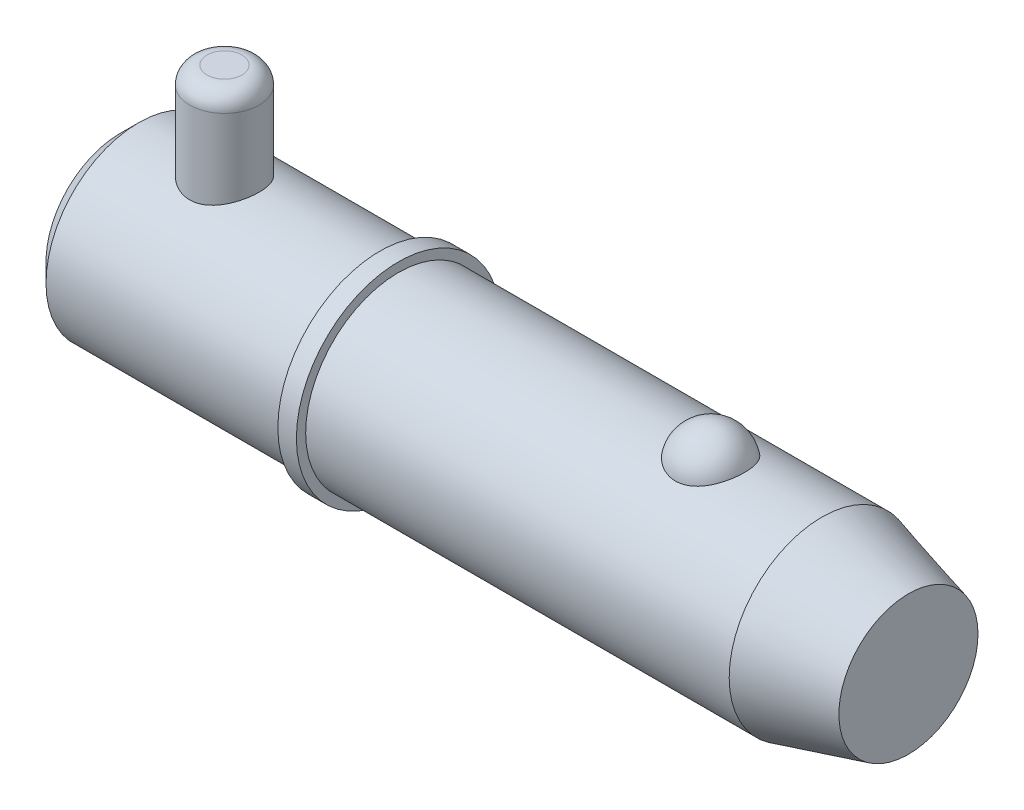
ISO-10303-21;
HEADER;
FILE_DESCRIPTION(('STEP AP214'),'2;1');
FILE_NAME('part.step','',(''),(''),'','','');
FILE_SCHEMA(('AUTOMOTIVE_DESIGN { 1 0 10303 214 1 1 1 1 }'));
ENDSEC;
DATA;
#1=APPLICATION_CONTEXT('core data for automotive mechanical design processes');
#2=APPLICATION_PROTOCOL_DEFINITION('international standard','automotive_design',2000,#1);
#3=PRODUCT_CONTEXT('',#1,'mechanical');
#4=PRODUCT('Part','Part','',(#3));
#5=PRODUCT_RELATED_PRODUCT_CATEGORY('part','',(#4));
#6=PRODUCT_DEFINITION_FORMATION('','',#4);
#7=PRODUCT_DEFINITION_CONTEXT('part definition',#1,'design');
#8=PRODUCT_DEFINITION('design','',#6,#7);
#9=PRODUCT_DEFINITION_SHAPE('','',#8);
#10=(LENGTH_UNIT() NAMED_UNIT(*) SI_UNIT(.MILLI.,.METRE.));
#11=(NAMED_UNIT(*) PLANE_ANGLE_UNIT() SI_UNIT($,.RADIAN.));
#12=(NAMED_UNIT(*) SI_UNIT($,.STERADIAN.) SOLID_ANGLE_UNIT());
#13=UNCERTAINTY_MEASURE_WITH_UNIT(LENGTH_MEASURE(1.E-05),#10,'distance_accuracy_value','');
#14=(GEOMETRIC_REPRESENTATION_CONTEXT(3) GLOBAL_UNCERTAINTY_ASSIGNED_CONTEXT((#13)) GLOBAL_UNIT_ASSIGNED_CONTEXT((#10,
#11,#12)) REPRESENTATION_CONTEXT('',''));
#15=CARTESIAN_POINT('',(0.,0.,0.));
#16=DIRECTION('',(0.,0.,1.));
#17=DIRECTION('',(1.,0.,0.));
#18=AXIS2_PLACEMENT_3D('',#15,#16,#17);
#19=CARTESIAN_POINT('',(14.28,25.4,0.));
#20=DIRECTION('',(0.,-1.,0.));
#21=DIRECTION('',(0.,0.,-1.));
#22=AXIS2_PLACEMENT_3D('',#19,#20,#21);
#23=CYLINDRICAL_SURFACE('',#22,4.76);
#24=CARTESIAN_POINT('',(14.28,-10.32,0.));
#25=DIRECTION('',(0.,1.,0.));
#26=DIRECTION('',(0.,0.,1.));
#27=AXIS2_PLACEMENT_3D('',#24,#25,#26);
#28=CIRCLE('',#27,4.76);
#29=CARTESIAN_POINT('',(14.28,-10.32,-4.76));
#30=VERTEX_POINT('',#29);
#31=EDGE_CURVE('P0_E25',#30,#30,#28,.T.);
#32=CARTESIAN_POINT('',(14.28,23.02,0.));
#33=DIRECTION('',(0.,1.,0.));
#34=DIRECTION('',(0.,0.,1.));
#35=AXIS2_PLACEMENT_3D('',#32,#33,#34);
#36=CIRCLE('',#35,4.76);
#37=CARTESIAN_POINT('',(14.28,23.02,-4.76));
#38=VERTEX_POINT('',#37);
#39=EDGE_CURVE('P0_E29',#38,#38,#36,.F.);
#40=CARTESIAN_POINT('',(14.28,-10.32,-4.76));
#41=CARTESIAN_POINT('',(14.28,-9.97270833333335,-4.76));
#42=CARTESIAN_POINT('',(14.28,-9.62541666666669,-4.76));
#43=CARTESIAN_POINT('',(14.28,-8.93083333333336,-4.76));
#44=CARTESIAN_POINT('',(14.28,-8.58354166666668,-4.76));
#45=CARTESIAN_POINT('',(14.28,-7.88895833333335,-4.76));
#46=CARTESIAN_POINT('',(14.28,-7.54166666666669,-4.76));
#47=CARTESIAN_POINT('',(14.28,-6.84708333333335,-4.76));
#48=CARTESIAN_POINT('',(14.28,-6.49979166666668,-4.76));
#49=CARTESIAN_POINT('',(14.28,-5.80520833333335,-4.76));
#50=CARTESIAN_POINT('',(14.28,-5.45791666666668,-4.76));
#51=CARTESIAN_POINT('',(14.28,-4.76333333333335,-4.76));
#52=CARTESIAN_POINT('',(14.28,-4.41604166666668,-4.76));
#53=CARTESIAN_POINT('',(14.28,-3.72145833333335,-4.76));
#54=CARTESIAN_POINT('',(14.28,-3.37416666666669,-4.76));
#55=CARTESIAN_POINT('',(14.28,-2.67958333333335,-4.76));
#56=CARTESIAN_POINT('',(14.28,-2.33229166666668,-4.76));
#57=CARTESIAN_POINT('',(14.28,-1.63770833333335,-4.76));
#58=CARTESIAN_POINT('',(14.28,-1.29041666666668,-4.76));
#59=CARTESIAN_POINT('',(14.28,-0.595833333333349,-4.76));
#60=CARTESIAN_POINT('',(14.28,-0.24854166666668,-4.76));
#61=CARTESIAN_POINT('',(14.28,0.446041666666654,-4.76));
#62=CARTESIAN_POINT('',(14.28,0.793333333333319,-4.76));
#63=CARTESIAN_POINT('',(14.28,1.48791666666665,-4.76));
#64=CARTESIAN_POINT('',(14.28,1.83520833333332,-4.76));
#65=CARTESIAN_POINT('',(14.28,2.52979166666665,-4.76));
#66=CARTESIAN_POINT('',(14.28,2.87708333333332,-4.76));
#67=CARTESIAN_POINT('',(14.28,3.57166666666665,-4.76));
#68=CARTESIAN_POINT('',(14.28,3.91895833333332,-4.76));
#69=CARTESIAN_POINT('',(14.28,4.61354166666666,-4.76));
#70=CARTESIAN_POINT('',(14.28,4.96083333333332,-4.76));
#71=CARTESIAN_POINT('',(14.28,5.65541666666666,-4.76));
#72=CARTESIAN_POINT('',(14.28,6.00270833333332,-4.76));
#73=CARTESIAN_POINT('',(14.28,6.69729166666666,-4.76));
#74=CARTESIAN_POINT('',(14.28,7.04458333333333,-4.76));
#75=CARTESIAN_POINT('',(14.28,7.73916666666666,-4.76));
#76=CARTESIAN_POINT('',(14.28,8.08645833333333,-4.76));
#77=CARTESIAN_POINT('',(14.28,8.78104166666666,-4.76));
#78=CARTESIAN_POINT('',(14.28,9.12833333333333,-4.76));
#79=CARTESIAN_POINT('',(14.28,9.82291666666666,-4.76));
#80=CARTESIAN_POINT('',(14.28,10.1702083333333,-4.76));
#81=CARTESIAN_POINT('',(14.28,10.8647916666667,-4.76));
#82=CARTESIAN_POINT('',(14.28,11.2120833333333,-4.76));
#83=CARTESIAN_POINT('',(14.28,11.9066666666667,-4.76));
#84=CARTESIAN_POINT('',(14.28,12.2539583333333,-4.76));
#85=CARTESIAN_POINT('',(14.28,12.9485416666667,-4.76));
#86=CARTESIAN_POINT('',(14.28,13.2958333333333,-4.76));
#87=CARTESIAN_POINT('',(14.28,13.9904166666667,-4.76));
#88=CARTESIAN_POINT('',(14.28,14.3377083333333,-4.76));
#89=CARTESIAN_POINT('',(14.28,15.0322916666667,-4.76));
#90=CARTESIAN_POINT('',(14.28,15.3795833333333,-4.76));
#91=CARTESIAN_POINT('',(14.28,16.0741666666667,-4.76));
#92=CARTESIAN_POINT('',(14.28,16.4214583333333,-4.76));
#93=CARTESIAN_POINT('',(14.28,17.1160416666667,-4.76));
#94=CARTESIAN_POINT('',(14.28,17.4633333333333,-4.76));
#95=CARTESIAN_POINT('',(14.28,18.1579166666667,-4.76));
#96=CARTESIAN_POINT('',(14.28,18.5052083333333,-4.76));
#97=CARTESIAN_POINT('',(14.28,19.1997916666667,-4.76));
#98=CARTESIAN_POINT('',(14.28,19.5470833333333,-4.76));
#99=CARTESIAN_POINT('',(14.28,20.2416666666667,-4.76));
#100=CARTESIAN_POINT('',(14.28,20.5889583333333,-4.76));
#101=CARTESIAN_POINT('',(14.28,21.2835416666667,-4.76));
#102=CARTESIAN_POINT('',(14.28,21.6308333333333,-4.76));
#103=CARTESIAN_POINT('',(14.28,22.3254166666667,-4.76));
#104=CARTESIAN_POINT('',(14.28,22.6727083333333,-4.76));
#105=CARTESIAN_POINT('',(14.28,23.02,-4.76));
#106=B_SPLINE_CURVE_WITH_KNOTS('',3,(#40,#41,#42,#43,#44,#45,#46,#47,#48,#49,#50,#51,#52,#53,
#54,#55,#56,#57,#58,#59,#60,#61,#62,#63,#64,#65,#66,#67,#68,#69,#70,#71,#72,#73,#74,#75,#76,#77,
#78,#79,#80,#81,#82,#83,#84,#85,#86,#87,#88,#89,#90,#91,#92,#93,#94,#95,#96,#97,#98,#99,#100,
#101,#102,#103,#104,#105),.UNSPECIFIED.,.F.,.F.,(4,2,2,2,2,2,2,2,2,2,2,2,2,2,2,2,2,2,2,2,2,2,2,
2,2,2,2,2,2,2,2,2,4),(0.,1.041875,2.08375,3.125625,4.1675,5.209375,6.25125,7.293125,
8.33500000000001,9.376875,10.41875,11.460625,12.5025,13.544375,14.58625,15.628125,16.67,
17.711875,18.75375,19.795625,20.8375,21.879375,22.92125,23.963125,25.005,26.046875,27.08875,
28.130625,29.1725,30.214375,31.25625,32.298125,33.34),.UNSPECIFIED.);
#107=EDGE_CURVE('P0_BSEAM14',#30,#38,#106,.T.);
#108=ORIENTED_EDGE('',*,*,#31,.T.);
#109=ORIENTED_EDGE('',*,*,#39,.T.);
#110=ORIENTED_EDGE('',*,*,#107,.T.);
#111=ORIENTED_EDGE('',*,*,#107,.F.);
#112=EDGE_LOOP('',(#108,#110,#109,#111));
#113=FACE_BOUND('',#112,.T.);
#114=ADVANCED_FACE('P0_F14',(#113),#23,.T.);
#115=CARTESIAN_POINT('',(14.28,25.4,0.));
#116=DIRECTION('',(0.,1.,0.));
#117=DIRECTION('',(0.,0.,1.));
#118=AXIS2_PLACEMENT_3D('',#115,#116,#117);
#119=PLANE('',#118);
#120=CARTESIAN_POINT('',(14.28,25.4,0.));
#121=DIRECTION('',(0.,1.,0.));
#122=DIRECTION('',(0.,0.,1.));
#123=AXIS2_PLACEMENT_3D('',#120,#121,#122);
#124=CIRCLE('',#123,2.38);
#125=CARTESIAN_POINT('',(14.28,25.4,2.38));
#126=VERTEX_POINT('',#125);
#127=EDGE_CURVE('P0_E10',#126,#126,#124,.T.);
#128=ORIENTED_EDGE('',*,*,#127,.T.);
#129=EDGE_LOOP('',(#128));
#130=FACE_BOUND('',#129,.T.);
#131=ADVANCED_FACE('P0_F46',(#130),#119,.T.);
#132=CARTESIAN_POINT('',(14.28,-12.7,0.));
#133=DIRECTION('',(0.,1.,0.));
#134=DIRECTION('',(0.,0.,1.));
#135=AXIS2_PLACEMENT_3D('',#132,#133,#134);
#136=PLANE('',#135);
#137=CARTESIAN_POINT('',(14.28,-12.7,0.));
#138=DIRECTION('',(0.,1.,0.));
#139=DIRECTION('',(0.,0.,1.));
#140=AXIS2_PLACEMENT_3D('',#137,#138,#139);
#141=CIRCLE('',#140,2.38);
#142=CARTESIAN_POINT('',(14.28,-12.7,2.38));
#143=VERTEX_POINT('',#142);
#144=EDGE_CURVE('P0_E21',#143,#143,#141,.F.);
#145=ORIENTED_EDGE('',*,*,#144,.T.);
#146=EDGE_LOOP('',(#145));
#147=FACE_BOUND('',#146,.T.);
#148=ADVANCED_FACE('P0_F43',(#147),#136,.F.);
#149=CARTESIAN_POINT('',(14.28,-10.32,0.));
#150=DIRECTION('',(0.,1.,0.));
#151=DIRECTION('',(0.,0.,1.));
#152=AXIS2_PLACEMENT_3D('',#149,#150,#151);
#153=DEGENERATE_TOROIDAL_SURFACE('',#152,2.38,2.38,.T.);
#154=ORIENTED_EDGE('',*,*,#144,.F.);
#155=EDGE_LOOP('',(#154));
#156=FACE_BOUND('',#155,.T.);
#157=ORIENTED_EDGE('',*,*,#31,.F.);
#158=EDGE_LOOP('',(#157));
#159=FACE_BOUND('',#158,.T.);
#160=ADVANCED_FACE('P0_F38',(#156,#159),#153,.T.);
#161=CARTESIAN_POINT('',(14.28,23.02,0.));
#162=DIRECTION('',(0.,1.,0.));
#163=DIRECTION('',(0.,0.,1.));
#164=AXIS2_PLACEMENT_3D('',#161,#162,#163);
#165=DEGENERATE_TOROIDAL_SURFACE('',#164,2.38,2.38,.T.);
#166=ORIENTED_EDGE('',*,*,#39,.F.);
#167=EDGE_LOOP('',(#166));
#168=FACE_BOUND('',#167,.T.);
#169=ORIENTED_EDGE('',*,*,#127,.F.);
#170=EDGE_LOOP('',(#169));
#171=FACE_BOUND('',#170,.T.);
#172=ADVANCED_FACE('P0_F16',(#168,#171),#165,.T.);
#173=CLOSED_SHELL('',(#114,#131,#148,#160,#172));
#174=MANIFOLD_SOLID_BREP('P0_B1',#173);
#175=CARTESIAN_POINT('',(0.,0.,0.));
#176=DIRECTION('',(1.,0.,0.));
#177=DIRECTION('',(0.,0.,-1.));
#178=AXIS2_PLACEMENT_3D('',#175,#176,#177);
#179=CYLINDRICAL_SURFACE('',#178,12.7);
#180=CARTESIAN_POINT('',(96.1007386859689,0.,0.));
#181=DIRECTION('',(1.,0.,0.));
#182=DIRECTION('',(0.,0.,-1.));
#183=AXIS2_PLACEMENT_3D('',#180,#181,#182);
#184=CIRCLE('',#183,12.7);
#185=CARTESIAN_POINT('',(96.1007386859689,0.,-12.7));
#186=VERTEX_POINT('',#185);
#187=EDGE_CURVE('P1_E81',#186,#186,#184,.T.);
#188=ORIENTED_EDGE('',*,*,#187,.F.);
#189=EDGE_LOOP('',(#188));
#190=FACE_BOUND('',#189,.T.);
#191=CARTESIAN_POINT('',(38.1,0.,0.));
#192=DIRECTION('',(1.,0.,0.));
#193=DIRECTION('',(0.,0.,-1.));
#194=AXIS2_PLACEMENT_3D('',#191,#192,#193);
#195=CIRCLE('',#194,12.7);
#196=CARTESIAN_POINT('',(38.1,0.,-12.7));
#197=VERTEX_POINT('',#196);
#198=EDGE_CURVE('P1_E85',#197,#197,#195,.T.);
#199=ORIENTED_EDGE('',*,*,#198,.T.);
#200=EDGE_LOOP('',(#199));
#201=FACE_BOUND('',#200,.T.);
#202=CARTESIAN_POINT('',(80.8600429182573,11.7500437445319,4.81938502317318));
#203=CARTESIAN_POINT('',(80.7350881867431,11.7500430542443,4.81938571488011));
#204=CARTESIAN_POINT('',(80.610144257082,11.7520975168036,4.81438658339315));
#205=CARTESIAN_POINT('',(80.3611425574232,11.760253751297,4.79442904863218));
#206=CARTESIAN_POINT('',(80.2370850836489,11.7663568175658,4.77946746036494));
#207=CARTESIAN_POINT('',(79.9909016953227,11.7824262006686,4.73971414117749));
#208=CARTESIAN_POINT('',(79.8687744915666,11.7923898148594,4.71492928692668));
#209=CARTESIAN_POINT('',(79.6271874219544,11.8158938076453,4.65571340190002));
#210=CARTESIAN_POINT('',(79.5077285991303,11.8294355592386,4.6212786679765));
#211=CARTESIAN_POINT('',(79.2725578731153,11.8596812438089,4.54309502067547));
#212=CARTESIAN_POINT('',(79.1568393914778,11.8763792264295,4.49936361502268));
#213=CARTESIAN_POINT('',(78.9296530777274,11.9124878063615,4.40287235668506));
#214=CARTESIAN_POINT('',(78.8181868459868,11.9318994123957,4.35010914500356));
#215=CARTESIAN_POINT('',(78.4912782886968,11.9934256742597,4.17881316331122));
#216=CARTESIAN_POINT('',(78.2831270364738,12.038858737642,4.04720756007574));
#217=CARTESIAN_POINT('',(77.8858509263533,12.1352173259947,3.748564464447));
#218=CARTESIAN_POINT('',(77.6974438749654,12.1862630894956,3.58061821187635));
#219=CARTESIAN_POINT('',(77.3505213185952,12.2875163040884,3.21600758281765));
#220=CARTESIAN_POINT('',(77.1920113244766,12.3377235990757,3.0193379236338));
#221=CARTESIAN_POINT('',(76.9016887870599,12.4344923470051,2.592916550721));
#222=CARTESIAN_POINT('',(76.7713762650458,12.4807925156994,2.36208286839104));
#223=CARTESIAN_POINT('',(76.5494079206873,12.5623454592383,1.88070399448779));
#224=CARTESIAN_POINT('',(76.4577554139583,12.5975972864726,1.63015711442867));
#225=CARTESIAN_POINT('',(76.3140466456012,12.6538414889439,1.1129886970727));
#226=CARTESIAN_POINT('',(76.2624990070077,12.6746503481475,0.846205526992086));
#227=CARTESIAN_POINT('',(76.2019771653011,12.699153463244,0.307085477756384));
#228=CARTESIAN_POINT('',(76.1930018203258,12.7028481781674,0.034748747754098));
#229=CARTESIAN_POINT('',(76.2177310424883,12.6927785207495,-0.506073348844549));
#230=CARTESIAN_POINT('',(76.2511899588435,12.6791146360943,-0.774571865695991));
#231=CARTESIAN_POINT('',(76.3596877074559,12.635882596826,-1.30170246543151));
#232=CARTESIAN_POINT('',(76.4347272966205,12.606314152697,-1.5603343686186));
#233=CARTESIAN_POINT('',(76.6250000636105,12.5342328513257,-2.06083899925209));
#234=CARTESIAN_POINT('',(76.7402872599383,12.4917026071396,-2.3026886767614));
#235=CARTESIAN_POINT('',(77.0087044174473,12.3981123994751,-2.76259600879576));
#236=CARTESIAN_POINT('',(77.1618374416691,12.3470517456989,-2.98065173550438));
#237=CARTESIAN_POINT('',(77.5035077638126,12.2416045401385,-3.38786328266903));
#238=CARTESIAN_POINT('',(77.6922017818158,12.1872040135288,-3.57688418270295));
#239=CARTESIAN_POINT('',(78.1002392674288,12.0814086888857,-3.91941073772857));
#240=CARTESIAN_POINT('',(78.3195800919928,12.0300136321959,-4.07291945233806));
#241=CARTESIAN_POINT('',(78.7783753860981,11.9373542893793,-4.33691289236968));
#242=CARTESIAN_POINT('',(79.0173044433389,11.8958982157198,-4.44824125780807));
#243=CARTESIAN_POINT('',(79.5124376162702,11.8268116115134,-4.62881985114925));
#244=CARTESIAN_POINT('',(79.7686351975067,11.7991758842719,-4.69808589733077));
#245=CARTESIAN_POINT('',(80.2771640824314,11.7622209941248,-4.78983181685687));
#246=CARTESIAN_POINT('',(80.5290414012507,11.7520502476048,-4.81449025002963));
#247=CARTESIAN_POINT('',(81.0335734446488,11.7485796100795,-4.82295735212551));
#248=CARTESIAN_POINT('',(81.2862280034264,11.7552763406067,-4.80677420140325));
#249=CARTESIAN_POINT('',(81.7768341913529,11.7842584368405,-4.73525430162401));
#250=CARTESIAN_POINT('',(82.0149984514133,11.8060486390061,-4.68116061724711));
#251=CARTESIAN_POINT('',(82.4784894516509,11.8622750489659,-4.53678133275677));
#252=CARTESIAN_POINT('',(82.7038151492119,11.8967122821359,-4.44649279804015));
#253=CARTESIAN_POINT('',(83.1408018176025,11.9754603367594,-4.2298761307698));
#254=CARTESIAN_POINT('',(83.3520579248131,12.0199699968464,-4.10280539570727));
#255=CARTESIAN_POINT('',(83.7506012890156,12.1138028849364,-3.81685409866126));
#256=CARTESIAN_POINT('',(83.9378830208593,12.163127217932,-3.65796622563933));
#257=CARTESIAN_POINT('',(84.2933509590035,12.2642343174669,-3.30364864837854));
#258=CARTESIAN_POINT('',(84.4601119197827,12.3160165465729,-3.10678783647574));
#259=CARTESIAN_POINT('',(84.7595799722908,12.4142566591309,-2.68748409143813));
#260=CARTESIAN_POINT('',(84.8922809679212,12.4607135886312,-2.46503658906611));
#261=CARTESIAN_POINT('',(85.1246912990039,12.5450236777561,-1.99289519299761));
#262=CARTESIAN_POINT('',(85.223215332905,12.5825557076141,-1.7425591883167));
#263=CARTESIAN_POINT('',(85.3792277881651,12.6431720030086,-1.22773734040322));
#264=CARTESIAN_POINT('',(85.4367157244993,12.6662560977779,-0.963251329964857));
#265=CARTESIAN_POINT('',(85.5095441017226,12.6956486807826,-0.427355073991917));
#266=CARTESIAN_POINT('',(85.5248378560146,12.7019385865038,-0.1559374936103));
#267=CARTESIAN_POINT('',(85.5127794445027,12.6970201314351,0.385928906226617));
#268=CARTESIAN_POINT('',(85.4854280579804,12.6858120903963,0.656377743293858));
#269=CARTESIAN_POINT('',(85.4130609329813,12.6568455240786,1.05454017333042));
#270=CARTESIAN_POINT('',(85.3837963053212,12.6451962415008,1.18577850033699));
#271=CARTESIAN_POINT('',(85.3150228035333,12.6181819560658,1.4451380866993));
#272=CARTESIAN_POINT('',(85.2755176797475,12.6028183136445,1.57326046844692));
#273=CARTESIAN_POINT('',(85.1864397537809,12.5687547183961,1.82554978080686));
#274=CARTESIAN_POINT('',(85.1368627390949,12.5500533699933,1.9497150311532));
#275=CARTESIAN_POINT('',(85.0279211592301,12.5098093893,2.19314370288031));
#276=CARTESIAN_POINT('',(84.9685601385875,12.4882677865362,2.31240887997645));
#277=CARTESIAN_POINT('',(84.8399712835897,12.4427679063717,2.54593031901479));
#278=CARTESIAN_POINT('',(84.7706888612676,12.4187964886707,2.66015396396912));
#279=CARTESIAN_POINT('',(84.622903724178,12.3691892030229,2.88202659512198));
#280=CARTESIAN_POINT('',(84.5444044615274,12.3435539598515,2.98967802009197));
#281=CARTESIAN_POINT('',(84.3785502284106,12.2912955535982,3.19774385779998));
#282=CARTESIAN_POINT('',(84.2911918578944,12.2646720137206,3.29815546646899));
#283=CARTESIAN_POINT('',(84.1081617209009,12.2111945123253,3.49095035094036));
#284=CARTESIAN_POINT('',(84.0124932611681,12.1843406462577,3.58333679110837));
#285=CARTESIAN_POINT('',(83.8136272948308,12.1312249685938,3.75922876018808));
#286=CARTESIAN_POINT('',(83.7104503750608,12.104961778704,3.84275713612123));
#287=CARTESIAN_POINT('',(83.4970133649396,12.0537284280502,4.00056406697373));
#288=CARTESIAN_POINT('',(83.3867562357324,12.028757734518,4.07484645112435));
#289=CARTESIAN_POINT('',(83.1597550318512,11.9808306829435,4.21367959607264));
#290=CARTESIAN_POINT('',(83.0430068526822,11.9578756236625,4.27822410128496));
#291=CARTESIAN_POINT('',(82.8039425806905,11.9147184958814,4.39698483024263));
#292=CARTESIAN_POINT('',(82.6816287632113,11.894515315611,4.45120522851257));
#293=CARTESIAN_POINT('',(82.422952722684,11.8561129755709,4.55255353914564));
#294=CARTESIAN_POINT('',(82.2862237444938,11.8381764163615,4.59884858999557));
#295=CARTESIAN_POINT('',(82.0086087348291,11.8069093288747,4.67853897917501));
#296=CARTESIAN_POINT('',(81.8677245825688,11.7935767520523,4.71194005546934));
#297=CARTESIAN_POINT('',(81.5830944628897,11.7720277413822,4.76552188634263));
#298=CARTESIAN_POINT('',(81.4393488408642,11.7638106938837,4.78570422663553));
#299=CARTESIAN_POINT('',(81.1504114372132,11.7528195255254,4.81263433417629));
#300=CARTESIAN_POINT('',(81.0052198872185,11.7500445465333,4.81938421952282));
#301=CARTESIAN_POINT('',(80.8600429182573,11.7500437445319,4.81938502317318));
#302=B_SPLINE_CURVE_WITH_KNOTS('',3,(#202,#203,#204,#205,#206,#207,#208,#209,#210,#211,#212,
#213,#214,#215,#216,#217,#218,#219,#220,#221,#222,#223,#224,#225,#226,#227,#228,#229,#230,#231,
#232,#233,#234,#235,#236,#237,#238,#239,#240,#241,#242,#243,#244,#245,#246,#247,#248,#249,#250,
#251,#252,#253,#254,#255,#256,#257,#258,#259,#260,#261,#262,#263,#264,#265,#266,#267,#268,#269,
#270,#271,#272,#273,#274,#275,#276,#277,#278,#279,#280,#281,#282,#283,#284,#285,#286,#287,#288,
#289,#290,#291,#292,#293,#294,#295,#296,#297,#298,#299,#300,#301),.UNSPECIFIED.,.T.,.F.,(4,2,2,
2,2,2,2,2,2,2,2,2,2,2,2,2,2,2,2,2,2,2,2,2,2,2,2,2,2,2,2,2,2,2,2,2,2,2,2,2,2,2,2,2,2,2,2,2,2,4),
(0.,0.374729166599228,0.749578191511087,1.12416526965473,1.49889629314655,1.87292776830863,
2.24709865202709,2.99481328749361,3.76399449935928,4.53331735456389,5.33683915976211,
6.14042986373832,6.95405296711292,7.76765424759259,8.57656703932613,9.38549455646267,
10.1955119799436,11.0055949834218,11.8193353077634,12.6330054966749,13.4294141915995,
14.2255231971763,14.9815786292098,15.7374826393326,16.4696948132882,17.2019663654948,
17.9501979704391,18.6986017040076,19.484470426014,20.2704797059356,21.0815215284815,
21.8925729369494,22.7045213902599,23.5164550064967,23.9209608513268,24.3253187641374,
24.7298461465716,25.1342272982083,25.54092555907,25.9474719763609,26.3541750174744,
26.7607169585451,27.1661834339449,27.5714814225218,27.9770386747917,28.3824315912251,
28.8181206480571,29.2536155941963,29.6890582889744,30.1244323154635),.UNSPECIFIED.);
#303=CARTESIAN_POINT('',(80.8600429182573,11.7500437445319,4.81938502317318));
#304=VERTEX_POINT('',#303);
#305=EDGE_CURVE('P1_E35',#304,#304,#302,.T.);
#306=ORIENTED_EDGE('',*,*,#305,.T.);
#307=EDGE_LOOP('',(#306));
#308=FACE_BOUND('',#307,.T.);
#309=ADVANCED_FACE('P1_F13',(#190,#201,#308),#179,.T.);
#310=CARTESIAN_POINT('',(0.,0.,0.));
#311=DIRECTION('',(-1.,0.,0.));
#312=DIRECTION('',(0.,0.,1.));
#313=AXIS2_PLACEMENT_3D('',#310,#311,#312);
#314=PLANE('',#313);
#315=CARTESIAN_POINT('',(0.,0.,0.));
#316=DIRECTION('',(1.,0.,0.));
#317=DIRECTION('',(0.,0.,-1.));
#318=AXIS2_PLACEMENT_3D('',#315,#316,#317);
#319=CIRCLE('',#318,10.16);
#320=CARTESIAN_POINT('',(0.,0.,-10.16));
#321=VERTEX_POINT('',#320);
#322=EDGE_CURVE('P1_E9',#321,#321,#319,.T.);
#323=ORIENTED_EDGE('',*,*,#322,.F.);
#324=EDGE_LOOP('',(#323));
#325=FACE_BOUND('',#324,.T.);
#326=ADVANCED_FACE('P1_F15',(#325),#314,.T.);
#327=CARTESIAN_POINT('',(2.53999999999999,0.,0.));
#328=DIRECTION('',(1.,0.,0.));
#329=DIRECTION('',(0.,0.,-1.));
#330=AXIS2_PLACEMENT_3D('',#327,#328,#329);
#331=CONICAL_SURFACE('',#330,12.7,0.78539816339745);
#332=ORIENTED_EDGE('',*,*,#322,.T.);
#333=EDGE_LOOP('',(#332));
#334=FACE_BOUND('',#333,.T.);
#335=CARTESIAN_POINT('',(2.53999999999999,0.,0.));
#336=DIRECTION('',(1.,0.,0.));
#337=DIRECTION('',(0.,0.,-1.));
#338=AXIS2_PLACEMENT_3D('',#335,#336,#337);
#339=CIRCLE('',#338,12.7);
#340=CARTESIAN_POINT('',(2.53999999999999,0.,-12.7));
#341=VERTEX_POINT('',#340);
#342=EDGE_CURVE('P1_E26',#341,#341,#339,.T.);
#343=ORIENTED_EDGE('',*,*,#342,.F.);
#344=EDGE_LOOP('',(#343));
#345=FACE_BOUND('',#344,.T.);
#346=ADVANCED_FACE('P1_F77',(#334,#345),#331,.T.);
#347=CARTESIAN_POINT('',(0.,0.,0.));
#348=DIRECTION('',(1.,0.,0.));
#349=DIRECTION('',(0.,0.,-1.));
#350=AXIS2_PLACEMENT_3D('',#347,#348,#349);
#351=CYLINDRICAL_SURFACE('',#350,12.7);
#352=CARTESIAN_POINT('',(14.28,-11.7742260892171,4.76));
#353=CARTESIAN_POINT('',(14.1514948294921,-11.7742255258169,4.76000061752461));
#354=CARTESIAN_POINT('',(14.0229980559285,-11.7763355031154,4.75479194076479));
#355=CARTESIAN_POINT('',(13.7669369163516,-11.7847043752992,4.73401198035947));
#356=CARTESIAN_POINT('',(13.6393728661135,-11.7909646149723,4.71843733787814));
#357=CARTESIAN_POINT('',(13.386226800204,-11.8074248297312,4.67709434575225));
#358=CARTESIAN_POINT('',(13.2606439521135,-11.8176231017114,4.65133040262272));
#359=CARTESIAN_POINT('',(13.0122434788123,-11.8416347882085,4.58985545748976));
#360=CARTESIAN_POINT('',(12.8894269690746,-11.8554496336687,4.55414051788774));
#361=CARTESIAN_POINT('',(12.6477622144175,-11.8862222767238,4.47320764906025));
#362=CARTESIAN_POINT('',(12.5289037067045,-11.9031710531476,4.4280169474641));
#363=CARTESIAN_POINT('',(12.2955059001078,-11.939736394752,4.32845291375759));
#364=CARTESIAN_POINT('',(12.1809682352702,-11.9593539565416,4.2740761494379));
#365=CARTESIAN_POINT('',(11.8448901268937,-12.0213893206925,4.09777237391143));
#366=CARTESIAN_POINT('',(11.6307077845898,-12.0670135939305,3.9626122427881));
#367=CARTESIAN_POINT('',(11.2179129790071,-12.1641514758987,3.65386230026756));
#368=CARTESIAN_POINT('',(11.0204399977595,-12.2158379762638,3.47881300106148));
#369=CARTESIAN_POINT('',(10.6568212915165,-12.3178468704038,3.09829182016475));
#370=CARTESIAN_POINT('',(10.4906822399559,-12.3681689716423,2.89281347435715));
#371=CARTESIAN_POINT('',(10.1890299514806,-12.4638367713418,2.44867909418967));
#372=CARTESIAN_POINT('',(10.054749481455,-12.5089552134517,2.20913281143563));
#373=CARTESIAN_POINT('',(9.82886079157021,-12.5870472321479,1.70885919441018));
#374=CARTESIAN_POINT('',(9.73723778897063,-12.620025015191,1.44813923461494));
#375=CARTESIAN_POINT('',(9.60324488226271,-12.6688874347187,0.9248423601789));
#376=CARTESIAN_POINT('',(9.55892269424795,-12.6854474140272,0.662829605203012));
#377=CARTESIAN_POINT('',(9.5145335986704,-12.7020320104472,0.134596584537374));
#378=CARTESIAN_POINT('',(9.5144523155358,-12.7020619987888,-0.131622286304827));
#379=CARTESIAN_POINT('',(9.55741019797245,-12.6860129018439,-0.646717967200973));
#380=CARTESIAN_POINT('',(9.59831845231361,-12.6707298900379,-0.895801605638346));
#381=CARTESIAN_POINT('',(9.71850987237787,-12.6268158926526,-1.38327219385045));
#382=CARTESIAN_POINT('',(9.79779575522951,-12.5981839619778,-1.62165838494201));
#383=CARTESIAN_POINT('',(9.99348296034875,-12.5298894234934,-2.08508424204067));
#384=CARTESIAN_POINT('',(10.110407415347,-12.4900724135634,-2.30987931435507));
#385=CARTESIAN_POINT('',(10.3775896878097,-12.4034373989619,-2.7372158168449));
#386=CARTESIAN_POINT('',(10.5278582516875,-12.3566171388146,-2.93975004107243));
#387=CARTESIAN_POINT('',(10.8677318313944,-12.257571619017,-3.32936830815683));
#388=CARTESIAN_POINT('',(11.0591227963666,-12.2051903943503,-3.51485714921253));
#389=CARTESIAN_POINT('',(11.4706087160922,-12.1031155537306,-3.85170663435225));
#390=CARTESIAN_POINT('',(11.6907108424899,-12.0534226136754,-4.00305872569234));
#391=CARTESIAN_POINT('',(12.1596597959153,-11.9613684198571,-4.27038218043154));
#392=CARTESIAN_POINT('',(12.4090353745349,-11.9191939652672,-4.38549550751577));
#393=CARTESIAN_POINT('',(12.9256290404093,-11.8491124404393,-4.57149117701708));
#394=CARTESIAN_POINT('',(13.1928371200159,-11.8211974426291,-4.64239810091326));
#395=CARTESIAN_POINT('',(13.7217488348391,-11.7846654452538,-4.73434137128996));
#396=CARTESIAN_POINT('',(13.9829438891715,-11.7750694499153,-4.75791141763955));
#397=CARTESIAN_POINT('',(14.5056760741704,-11.7734909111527,-4.76182097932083));
#398=CARTESIAN_POINT('',(14.7672131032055,-11.7815039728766,-4.74217128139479));
#399=CARTESIAN_POINT('',(15.2702140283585,-11.8132466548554,-4.66249544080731));
#400=CARTESIAN_POINT('',(15.5120417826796,-11.8362133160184,-4.60442726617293));
#401=CARTESIAN_POINT('',(15.9824097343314,-11.8943704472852,-4.45202868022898));
#402=CARTESIAN_POINT('',(16.2109472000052,-11.9295634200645,-4.35769084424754));
#403=CARTESIAN_POINT('',(16.6577741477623,-12.0098310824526,-4.13144368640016));
#404=CARTESIAN_POINT('',(16.8753590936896,-12.055226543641,-3.99825937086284));
#405=CARTESIAN_POINT('',(17.2859732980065,-12.150238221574,-3.69949845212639));
#406=CARTESIAN_POINT('',(17.4789935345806,-12.19985597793,-3.5339100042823));
#407=CARTESIAN_POINT('',(17.8477707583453,-12.3015434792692,-3.1624728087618));
#408=CARTESIAN_POINT('',(18.0216609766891,-12.3535695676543,-2.95473880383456));
#409=CARTESIAN_POINT('',(18.254545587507,-12.426745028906,-2.62277433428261));
#410=CARTESIAN_POINT('',(18.3275489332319,-12.4503382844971,-2.50865480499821));
#411=CARTESIAN_POINT('',(18.463723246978,-12.4952713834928,-2.27428971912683));
#412=CARTESIAN_POINT('',(18.5268984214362,-12.5166121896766,-2.15404681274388));
#413=CARTESIAN_POINT('',(18.6427140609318,-12.5563817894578,-1.90858448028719));
#414=CARTESIAN_POINT('',(18.6953855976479,-12.5748191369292,-1.78338108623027));
#415=CARTESIAN_POINT('',(18.7899337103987,-12.6083284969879,-1.52857834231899));
#416=CARTESIAN_POINT('',(18.8318147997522,-12.6234019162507,-1.39898085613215));
#417=CARTESIAN_POINT('',(18.9043819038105,-12.6497495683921,-1.13633254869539));
#418=CARTESIAN_POINT('',(18.9350698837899,-12.6610244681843,-1.00328233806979));
#419=CARTESIAN_POINT('',(18.9849303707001,-12.6794412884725,-0.734761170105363));
#420=CARTESIAN_POINT('',(19.0041035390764,-12.6865834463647,-0.59929035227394));
#421=CARTESIAN_POINT('',(19.0299427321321,-12.6962286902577,-0.335006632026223));
#422=CARTESIAN_POINT('',(19.0372742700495,-12.698978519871,-0.206267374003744));
#423=CARTESIAN_POINT('',(19.0414668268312,-12.7005496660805,0.0514515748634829));
#424=CARTESIAN_POINT('',(19.038324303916,-12.69936965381,0.180431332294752));
#425=CARTESIAN_POINT('',(19.0215965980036,-12.6931114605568,0.437551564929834));
#426=CARTESIAN_POINT('',(19.0080165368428,-12.6880351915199,0.565692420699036));
#427=CARTESIAN_POINT('',(18.9705519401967,-12.6741222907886,0.820297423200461));
#428=CARTESIAN_POINT('',(18.9466635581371,-12.665284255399,0.946760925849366));
#429=CARTESIAN_POINT('',(18.8895279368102,-12.6443449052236,1.19395899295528));
#430=CARTESIAN_POINT('',(18.8565273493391,-12.6323299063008,1.3147578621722));
#431=CARTESIAN_POINT('',(18.781239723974,-12.6052503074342,1.55308888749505));
#432=CARTESIAN_POINT('',(18.738949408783,-12.5901846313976,1.67061987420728));
#433=CARTESIAN_POINT('',(18.5986461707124,-12.5409473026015,2.01714406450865));
#434=CARTESIAN_POINT('',(18.4871532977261,-12.502717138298,2.24027279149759));
#435=CARTESIAN_POINT('',(18.2262440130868,-12.4173042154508,2.6742599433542));
#436=CARTESIAN_POINT('',(18.0754310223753,-12.3698127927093,2.88420891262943));
#437=CARTESIAN_POINT('',(17.7421836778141,-12.271667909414,3.27675114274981));
#438=CARTESIAN_POINT('',(17.5597380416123,-12.2210133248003,3.45933459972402));
#439=CARTESIAN_POINT('',(17.2605468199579,-12.1452079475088,3.7138066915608));
#440=CARTESIAN_POINT('',(17.1535518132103,-12.119328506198,3.79719993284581));
#441=CARTESIAN_POINT('',(16.9326449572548,-12.0688597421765,3.95467398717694));
#442=CARTESIAN_POINT('',(16.8187356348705,-12.0442699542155,4.02875817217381));
#443=CARTESIAN_POINT('',(16.5846234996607,-11.9971053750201,4.16711104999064));
#444=CARTESIAN_POINT('',(16.4644172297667,-11.9745317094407,4.23137427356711));
#445=CARTESIAN_POINT('',(16.2185866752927,-11.9321360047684,4.34949041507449));
#446=CARTESIAN_POINT('',(16.09296473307,-11.9123127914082,4.40334777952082));
#447=CARTESIAN_POINT('',(15.8314769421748,-11.875268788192,4.50232278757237));
#448=CARTESIAN_POINT('',(15.6954035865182,-11.8582009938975,4.54695127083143));
#449=CARTESIAN_POINT('',(15.4194002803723,-11.8284328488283,4.62383807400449));
#450=CARTESIAN_POINT('',(15.2794720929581,-11.815730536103,4.6561019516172));
#451=CARTESIAN_POINT('',(14.9969657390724,-11.7951940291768,4.70788444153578));
#452=CARTESIAN_POINT('',(14.8543884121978,-11.7873583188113,4.72740702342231));
#453=CARTESIAN_POINT('',(14.5678704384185,-11.7768749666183,4.75346370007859));
#454=CARTESIAN_POINT('',(14.4239299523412,-11.7742267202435,4.75999930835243));
#455=CARTESIAN_POINT('',(14.28,-11.7742260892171,4.76));
#456=B_SPLINE_CURVE_WITH_KNOTS('',3,(#352,#353,#354,#355,#356,#357,#358,#359,#360,#361,#362,
#363,#364,#365,#366,#367,#368,#369,#370,#371,#372,#373,#374,#375,#376,#377,#378,#379,#380,#381,
#382,#383,#384,#385,#386,#387,#388,#389,#390,#391,#392,#393,#394,#395,#396,#397,#398,#399,#400,
#401,#402,#403,#404,#405,#406,#407,#408,#409,#410,#411,#412,#413,#414,#415,#416,#417,#418,#419,
#420,#421,#422,#423,#424,#425,#426,#427,#428,#429,#430,#431,#432,#433,#434,#435,#436,#437,#438,
#439,#440,#441,#442,#443,#444,#445,#446,#447,#448,#449,#450,#451,#452,#453,#454,#455),
.UNSPECIFIED.,.T.,.F.,(4,2,2,2,2,2,2,2,2,2,2,2,2,2,2,2,2,2,2,2,2,2,2,2,2,2,2,2,2,2,2,2,2,2,2,2,
2,2,2,2,2,2,2,2,2,2,2,2,2,2,2,4),(0.,0.385378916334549,0.770882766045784,1.15622008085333,
1.54171009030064,1.92610725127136,2.31064835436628,3.07917291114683,3.88239385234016,
4.68578566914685,5.51648193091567,6.34689010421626,7.14151420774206,7.93588010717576,
8.69098665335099,9.44614666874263,10.2122918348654,10.9786842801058,11.789876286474,
12.6012713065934,13.4306405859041,14.2595482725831,15.0427613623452,15.8257790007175,
16.5716820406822,17.3177378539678,18.0917395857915,18.8660247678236,19.6893332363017,
20.1014571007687,20.5134040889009,20.9241137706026,21.3346513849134,21.7451168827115,
22.1555587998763,22.542011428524,22.928594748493,23.3149884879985,23.7015265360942,
24.0784835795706,24.4555738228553,25.2091300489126,25.994347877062,26.7798463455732,
27.1937428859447,27.6074890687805,28.0214648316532,28.4352633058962,28.8672794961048,
29.299101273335,29.7307884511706,30.1624253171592),.UNSPECIFIED.);
#457=CARTESIAN_POINT('',(14.28,-11.7742260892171,4.76));
#458=VERTEX_POINT('',#457);
#459=EDGE_CURVE('P1_E17',#458,#458,#456,.T.);
#460=ORIENTED_EDGE('',*,*,#459,.F.);
#461=EDGE_LOOP('',(#460));
#462=FACE_BOUND('',#461,.T.);
#463=CARTESIAN_POINT('',(14.28,11.7742260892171,4.76));
#464=CARTESIAN_POINT('',(14.4085051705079,11.7742255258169,4.76000061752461));
#465=CARTESIAN_POINT('',(14.5370019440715,11.7763355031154,4.75479194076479));
#466=CARTESIAN_POINT('',(14.7930630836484,11.7847043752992,4.73401198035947));
#467=CARTESIAN_POINT('',(14.9206271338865,11.7909646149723,4.71843733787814));
#468=CARTESIAN_POINT('',(15.173773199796,11.8074248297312,4.67709434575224));
#469=CARTESIAN_POINT('',(15.2993560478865,11.8176231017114,4.65133040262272));
#470=CARTESIAN_POINT('',(15.5477565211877,11.8416347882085,4.58985545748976));
#471=CARTESIAN_POINT('',(15.6705730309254,11.8554496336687,4.55414051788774));
#472=CARTESIAN_POINT('',(15.9122377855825,11.8862222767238,4.47320764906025));
#473=CARTESIAN_POINT('',(16.0310962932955,11.9031710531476,4.4280169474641));
#474=CARTESIAN_POINT('',(16.2644940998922,11.939736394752,4.32845291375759));
#475=CARTESIAN_POINT('',(16.3790317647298,11.9593539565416,4.2740761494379));
#476=CARTESIAN_POINT('',(16.7151098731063,12.0213893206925,4.09777237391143));
#477=CARTESIAN_POINT('',(16.9292922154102,12.0670135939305,3.96261224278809));
#478=CARTESIAN_POINT('',(17.3420870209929,12.1641514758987,3.65386230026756));
#479=CARTESIAN_POINT('',(17.5395600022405,12.2158379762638,3.47881300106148));
#480=CARTESIAN_POINT('',(17.9031787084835,12.3178468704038,3.09829182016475));
#481=CARTESIAN_POINT('',(18.0693177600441,12.3681689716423,2.89281347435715));
#482=CARTESIAN_POINT('',(18.3709700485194,12.4638367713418,2.44867909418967));
#483=CARTESIAN_POINT('',(18.505250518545,12.5089552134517,2.20913281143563));
#484=CARTESIAN_POINT('',(18.7311392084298,12.5870472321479,1.70885919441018));
#485=CARTESIAN_POINT('',(18.8227622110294,12.620025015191,1.44813923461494));
#486=CARTESIAN_POINT('',(18.9567551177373,12.6688874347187,0.924842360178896));
#487=CARTESIAN_POINT('',(19.0010773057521,12.6854474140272,0.662829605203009));
#488=CARTESIAN_POINT('',(19.0454664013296,12.7020320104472,0.134596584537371));
#489=CARTESIAN_POINT('',(19.0455476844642,12.7020619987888,-0.13162228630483));
#490=CARTESIAN_POINT('',(19.0025898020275,12.6860129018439,-0.646717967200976));
#491=CARTESIAN_POINT('',(18.9616815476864,12.6707298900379,-0.89580160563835));
#492=CARTESIAN_POINT('',(18.8414901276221,12.6268158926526,-1.38327219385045));
#493=CARTESIAN_POINT('',(18.7622042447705,12.5981839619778,-1.62165838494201));
#494=CARTESIAN_POINT('',(18.5665170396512,12.5298894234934,-2.08508424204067));
#495=CARTESIAN_POINT('',(18.449592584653,12.4900724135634,-2.30987931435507));
#496=CARTESIAN_POINT('',(18.1824103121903,12.4034373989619,-2.7372158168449));
#497=CARTESIAN_POINT('',(18.0321417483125,12.3566171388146,-2.93975004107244));
#498=CARTESIAN_POINT('',(17.6922681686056,12.257571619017,-3.32936830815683));
#499=CARTESIAN_POINT('',(17.5008772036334,12.2051903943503,-3.51485714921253));
#500=CARTESIAN_POINT('',(17.0893912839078,12.1031155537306,-3.85170663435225));
#501=CARTESIAN_POINT('',(16.8692891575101,12.0534226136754,-4.00305872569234));
#502=CARTESIAN_POINT('',(16.4003402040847,11.9613684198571,-4.27038218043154));
#503=CARTESIAN_POINT('',(16.1509646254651,11.9191939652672,-4.38549550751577));
#504=CARTESIAN_POINT('',(15.6343709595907,11.8491124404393,-4.57149117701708));
#505=CARTESIAN_POINT('',(15.367162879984,11.8211974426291,-4.64239810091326));
#506=CARTESIAN_POINT('',(14.8382511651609,11.7846654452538,-4.73434137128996));
#507=CARTESIAN_POINT('',(14.5770561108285,11.7750694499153,-4.75791141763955));
#508=CARTESIAN_POINT('',(14.0543239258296,11.7734909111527,-4.76182097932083));
#509=CARTESIAN_POINT('',(13.7927868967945,11.7815039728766,-4.74217128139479));
#510=CARTESIAN_POINT('',(13.2897859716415,11.8132466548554,-4.66249544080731));
#511=CARTESIAN_POINT('',(13.0479582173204,11.8362133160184,-4.60442726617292));
#512=CARTESIAN_POINT('',(12.5775902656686,11.8943704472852,-4.45202868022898));
#513=CARTESIAN_POINT('',(12.3490527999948,11.9295634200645,-4.35769084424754));
#514=CARTESIAN_POINT('',(11.9022258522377,12.0098310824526,-4.13144368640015));
#515=CARTESIAN_POINT('',(11.6846409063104,12.055226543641,-3.99825937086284));
#516=CARTESIAN_POINT('',(11.2740267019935,12.150238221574,-3.69949845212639));
#517=CARTESIAN_POINT('',(11.0810064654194,12.19985597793,-3.5339100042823));
#518=CARTESIAN_POINT('',(10.7122292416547,12.3015434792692,-3.1624728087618));
#519=CARTESIAN_POINT('',(10.5383390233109,12.3535695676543,-2.95473880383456));
#520=CARTESIAN_POINT('',(10.305454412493,12.426745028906,-2.6227743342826));
#521=CARTESIAN_POINT('',(10.2324510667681,12.4503382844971,-2.50865480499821));
#522=CARTESIAN_POINT('',(10.096276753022,12.4952713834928,-2.27428971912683));
#523=CARTESIAN_POINT('',(10.0331015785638,12.5166121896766,-2.15404681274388));
#524=CARTESIAN_POINT('',(9.91728593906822,12.5563817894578,-1.90858448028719));
#525=CARTESIAN_POINT('',(9.8646144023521,12.5748191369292,-1.78338108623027));
#526=CARTESIAN_POINT('',(9.77006628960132,12.6083284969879,-1.52857834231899));
#527=CARTESIAN_POINT('',(9.72818520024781,12.6234019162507,-1.39898085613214));
#528=CARTESIAN_POINT('',(9.65561809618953,12.6497495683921,-1.13633254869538));
#529=CARTESIAN_POINT('',(9.62493011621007,12.6610244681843,-1.00328233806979));
#530=CARTESIAN_POINT('',(9.57506962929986,12.6794412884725,-0.734761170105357));
#531=CARTESIAN_POINT('',(9.55589646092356,12.6865834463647,-0.599290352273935));
#532=CARTESIAN_POINT('',(9.53005726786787,12.6962286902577,-0.335006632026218));
#533=CARTESIAN_POINT('',(9.52272572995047,12.698978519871,-0.20626737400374));
#534=CARTESIAN_POINT('',(9.51853317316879,12.7005496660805,0.0514515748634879));
#535=CARTESIAN_POINT('',(9.52167569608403,12.69936965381,0.180431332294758));
#536=CARTESIAN_POINT('',(9.53840340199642,12.6931114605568,0.43755156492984));
#537=CARTESIAN_POINT('',(9.55198346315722,12.6880351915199,0.565692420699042));
#538=CARTESIAN_POINT('',(9.58944805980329,12.6741222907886,0.820297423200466));
#539=CARTESIAN_POINT('',(9.61333644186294,12.665284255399,0.946760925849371));
#540=CARTESIAN_POINT('',(9.67047206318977,12.6443449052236,1.19395899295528));
#541=CARTESIAN_POINT('',(9.7034726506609,12.6323299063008,1.31475786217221));
#542=CARTESIAN_POINT('',(9.77876027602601,12.6052503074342,1.55308888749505));
#543=CARTESIAN_POINT('',(9.82105059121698,12.5901846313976,1.67061987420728));
#544=CARTESIAN_POINT('',(9.96135382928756,12.5409473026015,2.01714406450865));
#545=CARTESIAN_POINT('',(10.0728467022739,12.502717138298,2.24027279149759));
#546=CARTESIAN_POINT('',(10.3337559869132,12.4173042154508,2.6742599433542));
#547=CARTESIAN_POINT('',(10.4845689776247,12.3698127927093,2.88420891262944));
#548=CARTESIAN_POINT('',(10.8178163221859,12.271667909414,3.27675114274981));
#549=CARTESIAN_POINT('',(11.0002619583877,12.2210133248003,3.45933459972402));
#550=CARTESIAN_POINT('',(11.2994531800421,12.1452079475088,3.7138066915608));
#551=CARTESIAN_POINT('',(11.4064481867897,12.119328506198,3.79719993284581));
#552=CARTESIAN_POINT('',(11.6273550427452,12.0688597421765,3.95467398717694));
#553=CARTESIAN_POINT('',(11.7412643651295,12.0442699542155,4.02875817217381));
#554=CARTESIAN_POINT('',(11.9753765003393,11.9971053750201,4.16711104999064));
#555=CARTESIAN_POINT('',(12.0955827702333,11.9745317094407,4.23137427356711));
#556=CARTESIAN_POINT('',(12.3414133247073,11.9321360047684,4.34949041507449));
#557=CARTESIAN_POINT('',(12.46703526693,11.9123127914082,4.40334777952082));
#558=CARTESIAN_POINT('',(12.7285230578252,11.875268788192,4.50232278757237));
#559=CARTESIAN_POINT('',(12.8645964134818,11.8582009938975,4.54695127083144));
#560=CARTESIAN_POINT('',(13.1405997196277,11.8284328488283,4.62383807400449));
#561=CARTESIAN_POINT('',(13.2805279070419,11.815730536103,4.6561019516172));
#562=CARTESIAN_POINT('',(13.5630342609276,11.7951940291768,4.70788444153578));
#563=CARTESIAN_POINT('',(13.7056115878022,11.7873583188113,4.72740702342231));
#564=CARTESIAN_POINT('',(13.9921295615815,11.7768749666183,4.75346370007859));
#565=CARTESIAN_POINT('',(14.1360700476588,11.7742267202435,4.75999930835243));
#566=CARTESIAN_POINT('',(14.28,11.7742260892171,4.76));
#567=B_SPLINE_CURVE_WITH_KNOTS('',3,(#463,#464,#465,#466,#467,#468,#469,#470,#471,#472,#473,
#474,#475,#476,#477,#478,#479,#480,#481,#482,#483,#484,#485,#486,#487,#488,#489,#490,#491,#492,
#493,#494,#495,#496,#497,#498,#499,#500,#501,#502,#503,#504,#505,#506,#507,#508,#509,#510,#511,
#512,#513,#514,#515,#516,#517,#518,#519,#520,#521,#522,#523,#524,#525,#526,#527,#528,#529,#530,
#531,#532,#533,#534,#535,#536,#537,#538,#539,#540,#541,#542,#543,#544,#545,#546,#547,#548,#549,
#550,#551,#552,#553,#554,#555,#556,#557,#558,#559,#560,#561,#562,#563,#564,#565,#566),
.UNSPECIFIED.,.T.,.F.,(4,2,2,2,2,2,2,2,2,2,2,2,2,2,2,2,2,2,2,2,2,2,2,2,2,2,2,2,2,2,2,2,2,2,2,2,
2,2,2,2,2,2,2,2,2,2,2,2,2,2,2,4),(0.,0.385378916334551,0.770882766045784,1.15622008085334,
1.54171009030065,1.92610725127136,2.31064835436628,3.07917291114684,3.88239385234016,
4.68578566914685,5.51648193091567,6.34689010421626,7.14151420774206,7.93588010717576,
8.690986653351,9.44614666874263,10.2122918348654,10.9786842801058,11.789876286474,
12.6012713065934,13.4306405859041,14.2595482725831,15.0427613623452,15.8257790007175,
16.5716820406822,17.3177378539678,18.0917395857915,18.8660247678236,19.6893332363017,
20.1014571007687,20.5134040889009,20.9241137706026,21.3346513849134,21.7451168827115,
22.1555587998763,22.542011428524,22.928594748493,23.3149884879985,23.7015265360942,
24.0784835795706,24.4555738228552,25.2091300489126,25.994347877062,26.7798463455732,
27.1937428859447,27.6074890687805,28.0214648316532,28.4352633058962,28.8672794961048,
29.299101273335,29.7307884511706,30.1624253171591),.UNSPECIFIED.);
#568=CARTESIAN_POINT('',(14.28,11.7742260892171,4.76));
#569=VERTEX_POINT('',#568);
#570=EDGE_CURVE('P1_E43',#569,#569,#567,.T.);
#571=ORIENTED_EDGE('',*,*,#570,.F.);
#572=EDGE_LOOP('',(#571));
#573=FACE_BOUND('',#572,.T.);
#574=ORIENTED_EDGE('',*,*,#342,.T.);
#575=EDGE_LOOP('',(#574));
#576=FACE_BOUND('',#575,.T.);
#577=CARTESIAN_POINT('',(35.56,0.,0.));
#578=DIRECTION('',(1.,0.,0.));
#579=DIRECTION('',(0.,0.,-1.));
#580=AXIS2_PLACEMENT_3D('',#577,#578,#579);
#581=CIRCLE('',#580,12.7);
#582=CARTESIAN_POINT('',(35.56,0.,-12.7));
#583=VERTEX_POINT('',#582);
#584=EDGE_CURVE('P1_E31',#583,#583,#581,.T.);
#585=ORIENTED_EDGE('',*,*,#584,.F.);
#586=EDGE_LOOP('',(#585));
#587=FACE_BOUND('',#586,.T.);
#588=ADVANCED_FACE('P1_F103',(#462,#573,#576,#587),#351,.T.);
#589=CARTESIAN_POINT('',(35.56,12.7,0.));
#590=DIRECTION('',(-1.,0.,0.));
#591=DIRECTION('',(0.,0.,1.));
#592=AXIS2_PLACEMENT_3D('',#589,#590,#591);
#593=PLANE('',#592);
#594=ORIENTED_EDGE('',*,*,#584,.T.);
#595=EDGE_LOOP('',(#594));
#596=FACE_BOUND('',#595,.T.);
#597=CARTESIAN_POINT('',(35.56,0.,0.));
#598=DIRECTION('',(1.,0.,0.));
#599=DIRECTION('',(0.,0.,-1.));
#600=AXIS2_PLACEMENT_3D('',#597,#598,#599);
#601=CIRCLE('',#600,13.97);
#602=CARTESIAN_POINT('',(35.56,0.,-13.97));
#603=VERTEX_POINT('',#602);
#604=EDGE_CURVE('P1_E91',#603,#603,#601,.T.);
#605=ORIENTED_EDGE('',*,*,#604,.F.);
#606=EDGE_LOOP('',(#605));
#607=FACE_BOUND('',#606,.T.);
#608=ADVANCED_FACE('P1_F100',(#596,#607),#593,.T.);
#609=CARTESIAN_POINT('',(0.,0.,0.));
#610=DIRECTION('',(1.,0.,0.));
#611=DIRECTION('',(0.,0.,-1.));
#612=AXIS2_PLACEMENT_3D('',#609,#610,#611);
#613=CYLINDRICAL_SURFACE('',#612,13.97);
#614=ORIENTED_EDGE('',*,*,#604,.T.);
#615=EDGE_LOOP('',(#614));
#616=FACE_BOUND('',#615,.T.);
#617=CARTESIAN_POINT('',(38.1,0.,0.));
#618=DIRECTION('',(1.,0.,0.));
#619=DIRECTION('',(0.,0.,-1.));
#620=AXIS2_PLACEMENT_3D('',#617,#618,#619);
#621=CIRCLE('',#620,13.97);
#622=CARTESIAN_POINT('',(38.1,0.,-13.97));
#623=VERTEX_POINT('',#622);
#624=EDGE_CURVE('P1_E88',#623,#623,#621,.T.);
#625=ORIENTED_EDGE('',*,*,#624,.F.);
#626=EDGE_LOOP('',(#625));
#627=FACE_BOUND('',#626,.T.);
#628=ADVANCED_FACE('P1_F68',(#616,#627),#613,.T.);
#629=CARTESIAN_POINT('',(38.1,13.97,0.));
#630=DIRECTION('',(1.,0.,0.));
#631=DIRECTION('',(0.,0.,-1.));
#632=AXIS2_PLACEMENT_3D('',#629,#630,#631);
#633=PLANE('',#632);
#634=ORIENTED_EDGE('',*,*,#624,.T.);
#635=EDGE_LOOP('',(#634));
#636=FACE_BOUND('',#635,.T.);
#637=ORIENTED_EDGE('',*,*,#198,.F.);
#638=EDGE_LOOP('',(#637));
#639=FACE_BOUND('',#638,.T.);
#640=ADVANCED_FACE('P1_F62',(#636,#639),#633,.T.);
#641=CARTESIAN_POINT('',(107.95,0.,0.));
#642=DIRECTION('',(-1.,0.,0.));
#643=DIRECTION('',(0.,0.,1.));
#644=AXIS2_PLACEMENT_3D('',#641,#642,#643);
#645=CONICAL_SURFACE('',#644,9.52500000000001,0.26179938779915);
#646=ORIENTED_EDGE('',*,*,#187,.T.);
#647=EDGE_LOOP('',(#646));
#648=FACE_BOUND('',#647,.T.);
#649=CARTESIAN_POINT('',(107.95,0.,0.));
#650=DIRECTION('',(1.,0.,0.));
#651=DIRECTION('',(0.,0.,-1.));
#652=AXIS2_PLACEMENT_3D('',#649,#650,#651);
#653=CIRCLE('',#652,9.52500000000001);
#654=CARTESIAN_POINT('',(107.95,0.,-9.52500000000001));
#655=VERTEX_POINT('',#654);
#656=EDGE_CURVE('P1_E42',#655,#655,#653,.T.);
#657=ORIENTED_EDGE('',*,*,#656,.F.);
#658=EDGE_LOOP('',(#657));
#659=FACE_BOUND('',#658,.T.);
#660=ADVANCED_FACE('P1_F59',(#648,#659),#645,.T.);
#661=CARTESIAN_POINT('',(107.95,9.52500000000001,0.));
#662=DIRECTION('',(1.,0.,0.));
#663=DIRECTION('',(0.,0.,-1.));
#664=AXIS2_PLACEMENT_3D('',#661,#662,#663);
#665=PLANE('',#664);
#666=ORIENTED_EDGE('',*,*,#656,.T.);
#667=EDGE_LOOP('',(#666));
#668=FACE_BOUND('',#667,.T.);
#669=ADVANCED_FACE('P1_F55',(#668),#665,.T.);
#670=CARTESIAN_POINT('',(80.8600429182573,11.43,0.));
#671=DIRECTION('',(-1.,0.,0.));
#672=DIRECTION('',(0.,1.,0.));
#673=AXIS2_PLACEMENT_3D('',#670,#671,#672);
#674=SPHERICAL_SURFACE('',#673,4.83);
#675=ORIENTED_EDGE('',*,*,#305,.F.);
#676=EDGE_LOOP('',(#675));
#677=FACE_BOUND('',#676,.T.);
#678=ADVANCED_FACE('P1_F50',(#677),#674,.T.);
#679=CARTESIAN_POINT('',(14.28,-13.97,0.));
#680=DIRECTION('',(0.,1.,0.));
#681=DIRECTION('',(0.,0.,1.));
#682=AXIS2_PLACEMENT_3D('',#679,#680,#681);
#683=CYLINDRICAL_SURFACE('',#682,4.76);
#684=ORIENTED_EDGE('',*,*,#459,.T.);
#685=EDGE_LOOP('',(#684));
#686=FACE_BOUND('',#685,.T.);
#687=ORIENTED_EDGE('',*,*,#570,.T.);
#688=EDGE_LOOP('',(#687));
#689=FACE_BOUND('',#688,.T.);
#690=ADVANCED_FACE('P1_F54',(#686,#689),#683,.F.);
#691=CLOSED_SHELL('',(#309,#326,#346,#588,#608,#628,#640,#660,#669,#678,#690));
#692=MANIFOLD_SOLID_BREP('P1_B1',#691);
#693=ADVANCED_BREP_SHAPE_REPRESENTATION('',(#18,#174,#692),#14);
#694=SHAPE_DEFINITION_REPRESENTATION(#9,#693);
ENDSEC;
END-ISO-10303-21;
